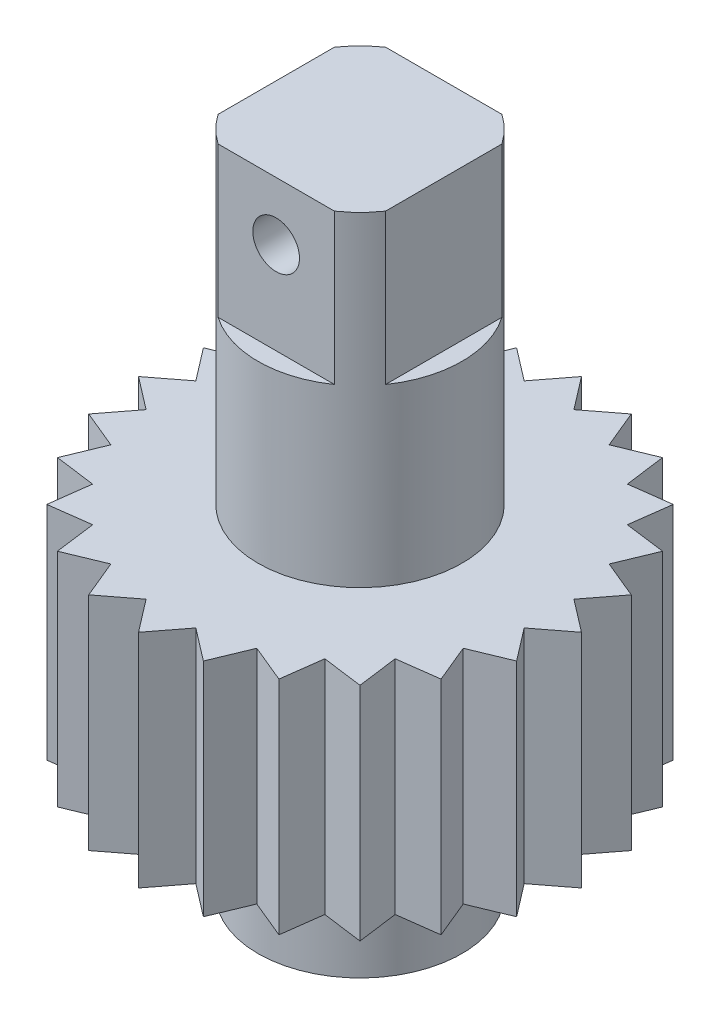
from build123d import *

# Parameters (mm, degrees)
SKETCH5_R           = 12.065
BASE_EXTRUDE_DEPTH  = 12.065
CUT_EXTRUDE1_DEPTH  = 21.897192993
CIRPATTERN1_COUNT   = 24
SKETCH7_R           = 5.55625
BOSS_EXTRUDE1_DEPTH = 9.525
BOSS_EXTRUDE2_DEPTH = 8.1788
BOSS_EXTRUDE3_START = 6.35
SKETCH9_R           = 5.55625
BOSS_EXTRUDE3_DEPTH = 6.35
SKETCH10_R          = 1.27
CUT_EXTRUDE2_DEPTH  = 6.35


with BuildPart() as part:
    # Sketch5 → Base-Extrude (new body)
    with BuildSketch(Plane(origin=(0, 0, 0), x_dir=(1, 0, 0), z_dir=(0, 1, 0))):
        with Locations(Location((0, 0, 0), (0, 0, 90))):
            Circle(SKETCH5_R)
    extrude(amount=BASE_EXTRUDE_DEPTH)

    # Sketch6 → Cut-Extrude1 (cut, through all)
    with BuildSketch(Plane(origin=(0, 12.065, 0), x_dir=(-1, 0, 0), z_dir=(0, 1, 0))):
        with BuildLine():
            Line((-11.653895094, -3.122651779), (-10.298121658, -1.355773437))
            Line((-10.298121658, -1.355773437), (-12.065, 0))
            ThreePointArc((-12.065, 0), (-11.961782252, -1.574798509), (-11.653895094, -3.122651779))
        make_face()
    cut_extrude1 = extrude(amount=-CUT_EXTRUDE1_DEPTH, mode=Mode.SUBTRACT)

    # CirPattern1: Cut-Extrude1 ×24 about axis
    cirpattern1_axis = Axis((0, 0, 0), (0, 1, 0))
    for i in range(1, CIRPATTERN1_COUNT):
        add(cut_extrude1.rotate(cirpattern1_axis, i * 360 / CIRPATTERN1_COUNT), mode=Mode.SUBTRACT)

    # Sketch7 → Boss-Extrude1 (add)
    with BuildSketch(Plane(origin=(0, 12.065, 0), x_dir=(-1, 0, 0), z_dir=(0, 1, 0))):
        with Locations(Location((0, 0, 0), (0, 0, 270))):
            Circle(SKETCH7_R)
    extrude(amount=BOSS_EXTRUDE1_DEPTH)

    # Sketch8 → Boss-Extrude2 (add)
    with BuildSketch(Plane(origin=(0, 21.59, 0), x_dir=(-1, 0, 0), z_dir=(0, 1, 0))):
        with BuildLine():
            Line((3.16879276, 4.5640625), (-3.16879276, 4.5640625))
            ThreePointArc((-3.16879276, 4.5640625), (-3.928862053, 3.928862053), (-4.5640625, 3.16879276))
            Line((-4.5640625, 3.16879276), (-4.5640625, -3.16879276))
            ThreePointArc((-4.5640625, -3.16879276), (-3.928862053, -3.928862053), (-3.16879276, -4.5640625))
            Line((-3.16879276, -4.5640625), (3.16879276, -4.5640625))
            ThreePointArc((3.16879276, -4.5640625), (3.928862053, -3.928862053), (4.5640625, -3.16879276))
            Line((4.5640625, -3.16879276), (4.5640625, 3.16879276))
            ThreePointArc((4.5640625, 3.16879276), (3.928862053, 3.928862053), (3.16879276, 4.5640625))
        make_face()
    extrude(amount=BOSS_EXTRUDE2_DEPTH)

    # Sketch9 → Boss-Extrude3 (add)
    with BuildSketch(Plane.XZ.offset(BOSS_EXTRUDE3_START)):
        with Locations(Location((0, 0, 0), (0, 0, 235.228055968))):
            Circle(SKETCH9_R)
    extrude(amount=-BOSS_EXTRUDE3_DEPTH)

    # Sketch10 → Cut-Extrude2 (cut)
    with BuildSketch(Plane.XY.offset(4.5640625)):
        with Locations((-0.0047625, 26.5938)):
            Circle(SKETCH10_R)
    extrude(amount=-CUT_EXTRUDE2_DEPTH, mode=Mode.SUBTRACT)


solid = part.part
